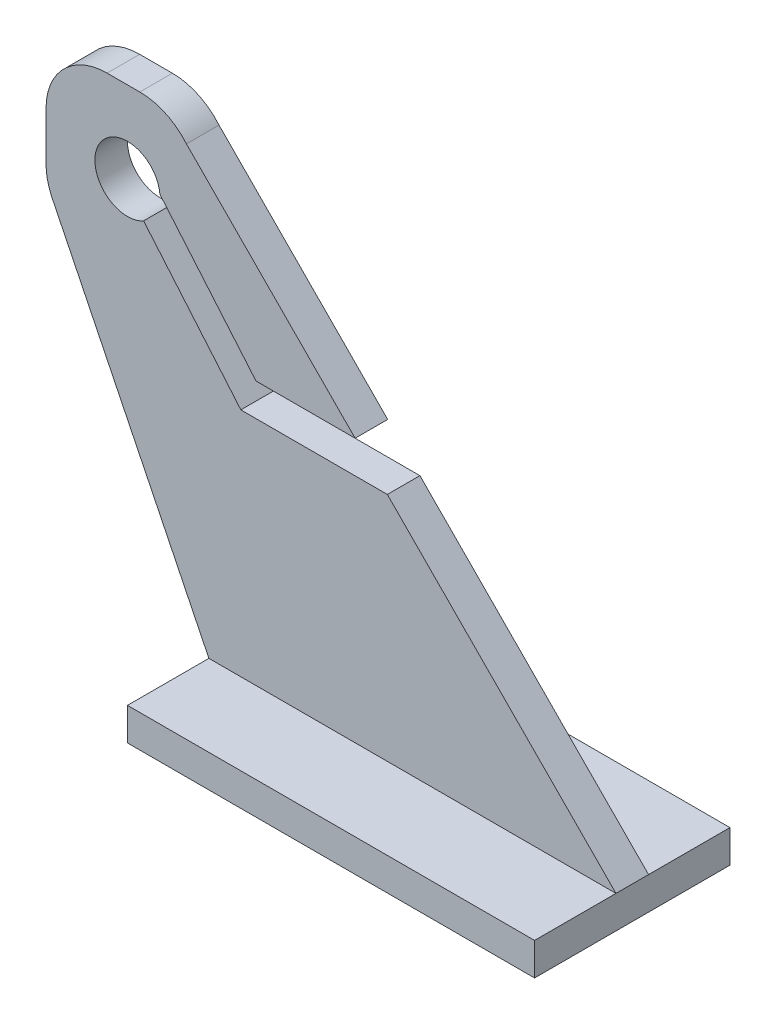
from build123d import *

# Parameters (mm, degrees)
SKETCH1_R                = 0.8
BOSS_EXTRUDE1_DEPTH      = 0.8
BOSS_EXTRUDE2_DEPTH      = 2.8
BOSS_EXTRUDE2_DEPTH_BACK = 2
SKETCH2_W                = 10
SKETCH2_H                = 0.8
CUT_EXTRUDE1_DEPTH       = 2.8


with BuildPart() as part:
    # Sketch1 → Boss-Extrude1 (new body)
    with BuildSketch(Plane.XY):
        with BuildLine():
            Line((1, 9.319619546), (1, 10.5))
            ThreePointArc((1, 10.5), (1.439339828, 11.560660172), (2.5, 12))
            Line((2.5, 12), (3.30372579, 12))
            ThreePointArc((3.30372579, 12), (3.935277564, 11.860566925), (4.449417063, 11.468189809))
            Line((4.449417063, 11.468189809), (15, 0.8))
            Line((15, 0.8), (15, 0))
            Line((15, 0), (5, 0))
            Line((5, 0), (5, 0.8))
            Line((5, 0.8), (1.130293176, 8.708143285))
            ThreePointArc((1.130293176, 8.708143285), (1.032934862, 9.007017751), (1, 9.319619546))
        make_face()
        with Locations((3, 10)):
            Circle(SKETCH1_R, mode=Mode.SUBTRACT)
    extrude(amount=BOSS_EXTRUDE1_DEPTH)

    # Sketch2 → Boss-Extrude2 (add, two sides: drawn at the far end of the back side and taken through both)
    with BuildSketch(Plane.XY.offset(-BOSS_EXTRUDE2_DEPTH_BACK)):
        with Locations((10, 0.4)):
            Rectangle(SKETCH2_W, SKETCH2_H)
    extrude(amount=BOSS_EXTRUDE2_DEPTH + BOSS_EXTRUDE2_DEPTH_BACK)

    # Sketch3 → Cut-Extrude1 (cut)
    with BuildSketch(Plane.XY.offset(0.8)):
        Polygon((3.056727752, 9.707637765), (5.785319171, 6.478804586), (10.116022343, 6.478804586), (10.116022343, 7.278804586), (6.156665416, 7.278804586), (3.667763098, 10.224005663), align=None)
    extrude(amount=-CUT_EXTRUDE1_DEPTH, mode=Mode.SUBTRACT)


solid = part.part
